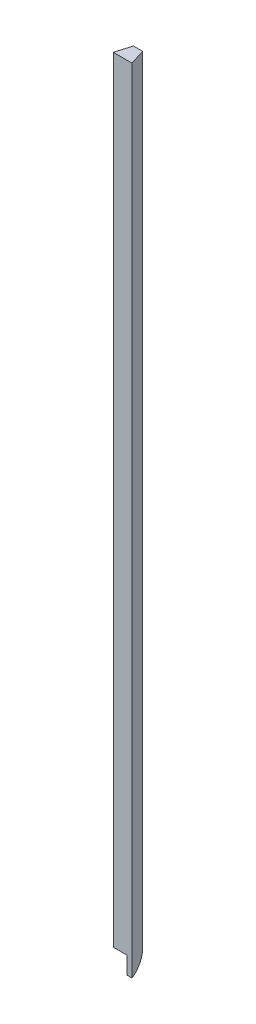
ISO-10303-21;
HEADER;
FILE_DESCRIPTION(('STEP AP214'),'2;1');
FILE_NAME('part.step','',(''),(''),'','','');
FILE_SCHEMA(('AUTOMOTIVE_DESIGN { 1 0 10303 214 1 1 1 1 }'));
ENDSEC;
DATA;
#1=APPLICATION_CONTEXT('core data for automotive mechanical design processes');
#2=APPLICATION_PROTOCOL_DEFINITION('international standard','automotive_design',2000,#1);
#3=PRODUCT_CONTEXT('',#1,'mechanical');
#4=PRODUCT('Part','Part','',(#3));
#5=PRODUCT_RELATED_PRODUCT_CATEGORY('part','',(#4));
#6=PRODUCT_DEFINITION_FORMATION('','',#4);
#7=PRODUCT_DEFINITION_CONTEXT('part definition',#1,'design');
#8=PRODUCT_DEFINITION('design','',#6,#7);
#9=PRODUCT_DEFINITION_SHAPE('','',#8);
#10=(LENGTH_UNIT() NAMED_UNIT(*) SI_UNIT(.MILLI.,.METRE.));
#11=(NAMED_UNIT(*) PLANE_ANGLE_UNIT() SI_UNIT($,.RADIAN.));
#12=(NAMED_UNIT(*) SI_UNIT($,.STERADIAN.) SOLID_ANGLE_UNIT());
#13=UNCERTAINTY_MEASURE_WITH_UNIT(LENGTH_MEASURE(1.E-05),#10,'distance_accuracy_value','');
#14=(GEOMETRIC_REPRESENTATION_CONTEXT(3) GLOBAL_UNCERTAINTY_ASSIGNED_CONTEXT((#13)) GLOBAL_UNIT_ASSIGNED_CONTEXT((#10,
#11,#12)) REPRESENTATION_CONTEXT('',''));
#15=CARTESIAN_POINT('',(0.,0.,0.));
#16=DIRECTION('',(0.,0.,1.));
#17=DIRECTION('',(1.,0.,0.));
#18=AXIS2_PLACEMENT_3D('',#15,#16,#17);
#19=CARTESIAN_POINT('',(0.,0.,0.));
#20=DIRECTION('',(0.,1.,0.));
#21=DIRECTION('',(0.,0.,1.));
#22=AXIS2_PLACEMENT_3D('',#19,#20,#21);
#23=PLANE('',#22);
#24=DIRECTION('',(0.,0.,-1.));
#25=VECTOR('',#24,1.);
#26=CARTESIAN_POINT('',(3.81,0.,0.));
#27=LINE('',#26,#25);
#28=CARTESIAN_POINT('',(3.80999999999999,0.,0.));
#29=VERTEX_POINT('',#28);
#30=CARTESIAN_POINT('',(3.81,0.,-12.7));
#31=VERTEX_POINT('',#30);
#32=EDGE_CURVE('E55',#29,#31,#27,.T.);
#33=ORIENTED_EDGE('',*,*,#32,.F.);
#34=DIRECTION('',(1.,0.,0.));
#35=VECTOR('',#34,1.);
#36=CARTESIAN_POINT('',(-7.62,0.,0.));
#37=LINE('',#36,#35);
#38=CARTESIAN_POINT('',(-7.62,0.,0.));
#39=VERTEX_POINT('',#38);
#40=EDGE_CURVE('E131',#39,#29,#37,.T.);
#41=ORIENTED_EDGE('',*,*,#40,.F.);
#42=DIRECTION('',(-0.287347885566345,0.,0.957826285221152));
#43=VECTOR('',#42,1.);
#44=CARTESIAN_POINT('',(-3.81,0.,-12.7));
#45=LINE('',#44,#43);
#46=CARTESIAN_POINT('',(-3.81,0.,-12.7));
#47=VERTEX_POINT('',#46);
#48=EDGE_CURVE('E119',#47,#39,#45,.T.);
#49=ORIENTED_EDGE('',*,*,#48,.F.);
#50=DIRECTION('',(-1.,0.,0.));
#51=VECTOR('',#50,1.);
#52=CARTESIAN_POINT('',(3.81,0.,-12.7));
#53=LINE('',#52,#51);
#54=EDGE_CURVE('E77',#31,#47,#53,.T.);
#55=ORIENTED_EDGE('',*,*,#54,.F.);
#56=EDGE_LOOP('',(#33,#41,#49,#55));
#57=FACE_BOUND('',#56,.T.);
#58=ADVANCED_FACE('F38',(#57),#23,.F.);
#59=CARTESIAN_POINT('',(-3.81,635.,-12.7));
#60=DIRECTION('',(0.957826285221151,0.,0.287347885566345));
#61=DIRECTION('',(0.287347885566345,0.,-0.957826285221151));
#62=AXIS2_PLACEMENT_3D('',#59,#60,#61);
#63=PLANE('',#62);
#64=ORIENTED_EDGE('',*,*,#48,.T.);
#65=DIRECTION('',(0.,-1.,0.));
#66=VECTOR('',#65,1.);
#67=CARTESIAN_POINT('',(-7.62,635.,0.));
#68=LINE('',#67,#66);
#69=CARTESIAN_POINT('',(-7.62,635.,0.));
#70=VERTEX_POINT('',#69);
#71=EDGE_CURVE('E11',#70,#39,#68,.T.);
#72=ORIENTED_EDGE('',*,*,#71,.F.);
#73=DIRECTION('',(-0.287347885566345,0.,0.957826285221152));
#74=VECTOR('',#73,1.);
#75=CARTESIAN_POINT('',(-3.81,635.,-12.7));
#76=LINE('',#75,#74);
#77=CARTESIAN_POINT('',(-3.81,635.,-12.7));
#78=VERTEX_POINT('',#77);
#79=EDGE_CURVE('E122',#78,#70,#76,.T.);
#80=ORIENTED_EDGE('',*,*,#79,.F.);
#81=DIRECTION('',(0.,-1.,0.));
#82=VECTOR('',#81,1.);
#83=CARTESIAN_POINT('',(-3.81,635.,-12.7));
#84=LINE('',#83,#82);
#85=EDGE_CURVE('E128',#78,#47,#84,.T.);
#86=ORIENTED_EDGE('',*,*,#85,.T.);
#87=EDGE_LOOP('',(#64,#72,#80,#86));
#88=FACE_BOUND('',#87,.T.);
#89=ADVANCED_FACE('F40',(#88),#63,.F.);
#90=CARTESIAN_POINT('',(-7.62,635.,0.));
#91=DIRECTION('',(0.,0.,-1.));
#92=DIRECTION('',(-1.,0.,0.));
#93=AXIS2_PLACEMENT_3D('',#90,#91,#92);
#94=PLANE('',#93);
#95=ORIENTED_EDGE('',*,*,#40,.T.);
#96=DIRECTION('',(0.,1.,0.));
#97=VECTOR('',#96,1.);
#98=CARTESIAN_POINT('',(3.81,-14.224,0.));
#99=LINE('',#98,#97);
#100=CARTESIAN_POINT('',(3.81,-14.224,0.));
#101=VERTEX_POINT('',#100);
#102=EDGE_CURVE('E117',#101,#29,#99,.T.);
#103=ORIENTED_EDGE('',*,*,#102,.F.);
#104=DIRECTION('',(-1.,0.,0.));
#105=VECTOR('',#104,1.);
#106=CARTESIAN_POINT('',(7.62,-14.224,0.));
#107=LINE('',#106,#105);
#108=CARTESIAN_POINT('',(7.62,-14.224,0.));
#109=VERTEX_POINT('',#108);
#110=EDGE_CURVE('E104',#109,#101,#107,.T.);
#111=ORIENTED_EDGE('',*,*,#110,.F.);
#112=DIRECTION('',(0.,-1.,0.));
#113=VECTOR('',#112,1.);
#114=CARTESIAN_POINT('',(7.62,635.,0.));
#115=LINE('',#114,#113);
#116=CARTESIAN_POINT('',(7.62,635.,0.));
#117=VERTEX_POINT('',#116);
#118=EDGE_CURVE('E47',#117,#109,#115,.T.);
#119=ORIENTED_EDGE('',*,*,#118,.F.);
#120=DIRECTION('',(1.,0.,0.));
#121=VECTOR('',#120,1.);
#122=CARTESIAN_POINT('',(-7.62,635.,0.));
#123=LINE('',#122,#121);
#124=EDGE_CURVE('E84',#70,#117,#123,.T.);
#125=ORIENTED_EDGE('',*,*,#124,.F.);
#126=ORIENTED_EDGE('',*,*,#71,.T.);
#127=EDGE_LOOP('',(#95,#103,#111,#119,#125,#126));
#128=FACE_BOUND('',#127,.T.);
#129=ADVANCED_FACE('F146',(#128),#94,.F.);
#130=CARTESIAN_POINT('',(7.62,635.,0.));
#131=DIRECTION('',(-0.957826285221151,0.,0.287347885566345));
#132=DIRECTION('',(0.287347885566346,0.,0.957826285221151));
#133=AXIS2_PLACEMENT_3D('',#130,#131,#132);
#134=PLANE('',#133);
#135=ORIENTED_EDGE('',*,*,#118,.T.);
#136=CARTESIAN_POINT('',(7.8486,-0.761999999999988,0.762000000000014));
#137=DIRECTION('',(-0.957826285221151,0.,0.287347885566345));
#138=DIRECTION('',(-0.287347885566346,0.,-0.957826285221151));
#139=AXIS2_PLACEMENT_3D('',#136,#137,#138);
#140=ELLIPSE('',#139,14.077238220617,13.4835487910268);
#141=CARTESIAN_POINT('',(3.81,-1.52399999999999,-12.7));
#142=VERTEX_POINT('',#141);
#143=EDGE_CURVE('E101',#109,#142,#140,.F.);
#144=ORIENTED_EDGE('',*,*,#143,.T.);
#145=DIRECTION('',(0.,1.,0.));
#146=VECTOR('',#145,1.);
#147=CARTESIAN_POINT('',(3.81,-14.224,-12.7));
#148=LINE('',#147,#146);
#149=EDGE_CURVE('E113',#142,#31,#148,.T.);
#150=ORIENTED_EDGE('',*,*,#149,.T.);
#151=DIRECTION('',(0.,-1.,0.));
#152=VECTOR('',#151,1.);
#153=CARTESIAN_POINT('',(3.81,635.,-12.7));
#154=LINE('',#153,#152);
#155=CARTESIAN_POINT('',(3.81,635.,-12.7));
#156=VERTEX_POINT('',#155);
#157=EDGE_CURVE('E141',#156,#31,#154,.T.);
#158=ORIENTED_EDGE('',*,*,#157,.F.);
#159=DIRECTION('',(-0.287347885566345,0.,-0.957826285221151));
#160=VECTOR('',#159,1.);
#161=CARTESIAN_POINT('',(7.62,635.,0.));
#162=LINE('',#161,#160);
#163=EDGE_CURVE('E125',#117,#156,#162,.T.);
#164=ORIENTED_EDGE('',*,*,#163,.F.);
#165=EDGE_LOOP('',(#135,#144,#150,#158,#164));
#166=FACE_BOUND('',#165,.T.);
#167=ADVANCED_FACE('F111',(#166),#134,.F.);
#168=CARTESIAN_POINT('',(3.81,635.,-12.7));
#169=DIRECTION('',(0.,0.,1.));
#170=DIRECTION('',(1.,0.,0.));
#171=AXIS2_PLACEMENT_3D('',#168,#169,#170);
#172=PLANE('',#171);
#173=ORIENTED_EDGE('',*,*,#54,.T.);
#174=ORIENTED_EDGE('',*,*,#85,.F.);
#175=DIRECTION('',(-1.,0.,0.));
#176=VECTOR('',#175,1.);
#177=CARTESIAN_POINT('',(3.81,635.,-12.7));
#178=LINE('',#177,#176);
#179=EDGE_CURVE('E64',#156,#78,#178,.T.);
#180=ORIENTED_EDGE('',*,*,#179,.F.);
#181=ORIENTED_EDGE('',*,*,#157,.T.);
#182=EDGE_LOOP('',(#173,#174,#180,#181));
#183=FACE_BOUND('',#182,.T.);
#184=ADVANCED_FACE('F152',(#183),#172,.F.);
#185=CARTESIAN_POINT('',(0.,635.,0.));
#186=DIRECTION('',(0.,1.,0.));
#187=DIRECTION('',(0.,0.,1.));
#188=AXIS2_PLACEMENT_3D('',#185,#186,#187);
#189=PLANE('',#188);
#190=ORIENTED_EDGE('',*,*,#79,.T.);
#191=ORIENTED_EDGE('',*,*,#124,.T.);
#192=ORIENTED_EDGE('',*,*,#163,.T.);
#193=ORIENTED_EDGE('',*,*,#179,.T.);
#194=EDGE_LOOP('',(#190,#191,#192,#193));
#195=FACE_BOUND('',#194,.T.);
#196=ADVANCED_FACE('F161',(#195),#189,.T.);
#197=CARTESIAN_POINT('',(3.81,-14.224,0.));
#198=DIRECTION('',(1.,0.,0.));
#199=DIRECTION('',(0.,0.,-1.));
#200=AXIS2_PLACEMENT_3D('',#197,#198,#199);
#201=PLANE('',#200);
#202=ORIENTED_EDGE('',*,*,#149,.F.);
#203=CARTESIAN_POINT('',(3.81,-0.761999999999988,0.762000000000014));
#204=DIRECTION('',(1.,0.,0.));
#205=DIRECTION('',(0.,0.,1.));
#206=AXIS2_PLACEMENT_3D('',#203,#204,#205);
#207=CIRCLE('',#206,13.4835487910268);
#208=EDGE_CURVE('E98',#101,#142,#207,.T.);
#209=ORIENTED_EDGE('',*,*,#208,.F.);
#210=ORIENTED_EDGE('',*,*,#102,.T.);
#211=ORIENTED_EDGE('',*,*,#32,.T.);
#212=EDGE_LOOP('',(#202,#209,#210,#211));
#213=FACE_BOUND('',#212,.T.);
#214=ADVANCED_FACE('F116',(#213),#201,.F.);
#215=CARTESIAN_POINT('',(7.62,-0.761999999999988,0.762000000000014));
#216=DIRECTION('',(-1.,0.,0.));
#217=DIRECTION('',(0.,0.,1.));
#218=AXIS2_PLACEMENT_3D('',#215,#216,#217);
#219=CYLINDRICAL_SURFACE('',#218,13.4835487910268);
#220=ORIENTED_EDGE('',*,*,#110,.T.);
#221=ORIENTED_EDGE('',*,*,#208,.T.);
#222=ORIENTED_EDGE('',*,*,#143,.F.);
#223=EDGE_LOOP('',(#220,#221,#222));
#224=FACE_BOUND('',#223,.T.);
#225=ADVANCED_FACE('F100',(#224),#219,.T.);
#226=CLOSED_SHELL('',(#58,#89,#129,#167,#184,#196,#214,#225));
#227=MANIFOLD_SOLID_BREP('B2',#226);
#228=ADVANCED_BREP_SHAPE_REPRESENTATION('',(#18,#227),#14);
#229=SHAPE_DEFINITION_REPRESENTATION(#9,#228);
ENDSEC;
END-ISO-10303-21;
